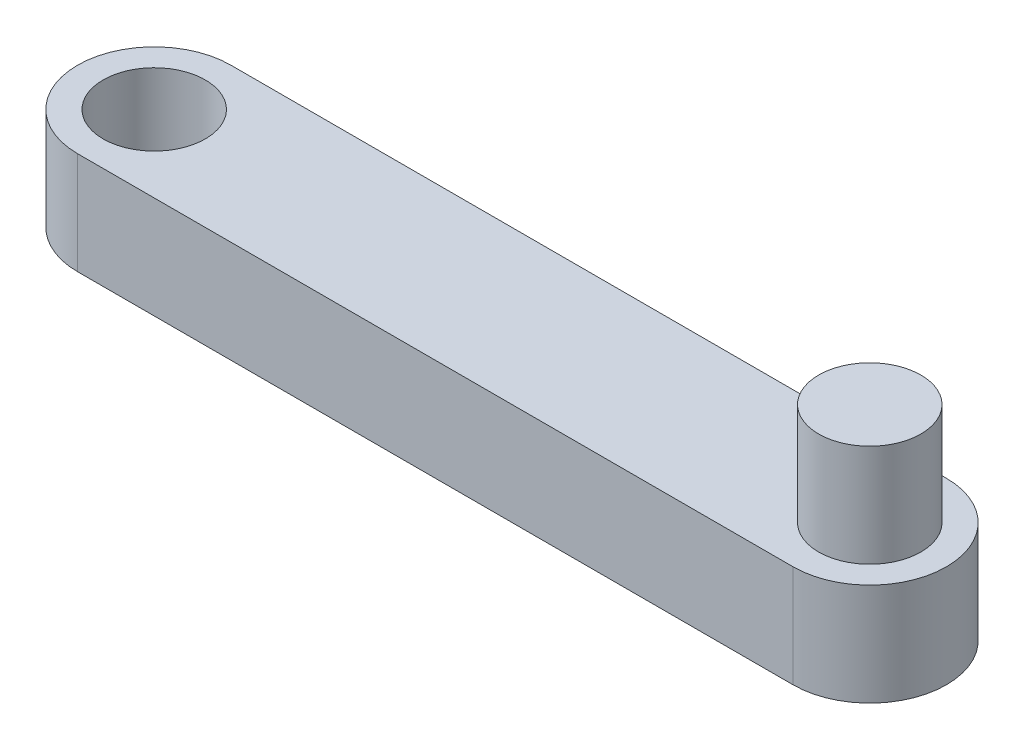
from build123d import *

# Parameters (mm, degrees)
SZKIC1_R                    = 5
DODANIE_WYCI_GNI_CIE1_DEPTH = 10
SZKIC1_2_R                  = 5
DODANIE_WYCI_GNI_CIE2_DEPTH = 20


with BuildPart() as part:
    # Szkic1 → Dodanie-wyci_gni_cie1 (new body)
    with BuildSketch(Plane(origin=(0, 0, 0), x_dir=(1, 0, 0), z_dir=(0, 1, 0))):
        with BuildLine():
            Line((0, 7.5), (70, 7.5))
            ThreePointArc((70, 7.5), (77.5, 0), (70, -7.5))
            Line((70, -7.5), (0, -7.5))
            ThreePointArc((0, -7.5), (-7.5, 0), (0, 7.5))
        make_face()
        with Locations(Location((0, 0, 0), (0, 0, 270))):
            Circle(SZKIC1_R, mode=Mode.SUBTRACT)
        with Locations(Location((70, 0, 0), (0, 0, 270))):
            Circle(SZKIC1_R, mode=Mode.SUBTRACT)
    extrude(amount=DODANIE_WYCI_GNI_CIE1_DEPTH)

    # Szkic1_2 → Dodanie-wyci_gni_cie2 (add)
    with BuildSketch(Plane(origin=(0, 0, 0), x_dir=(1, 0, 0), z_dir=(0, 1, 0))):
        with Locations(Location((70, 0, 0), (0, 0, 270))):
            Circle(SZKIC1_2_R)
    extrude(amount=DODANIE_WYCI_GNI_CIE2_DEPTH)


solid = part.part
